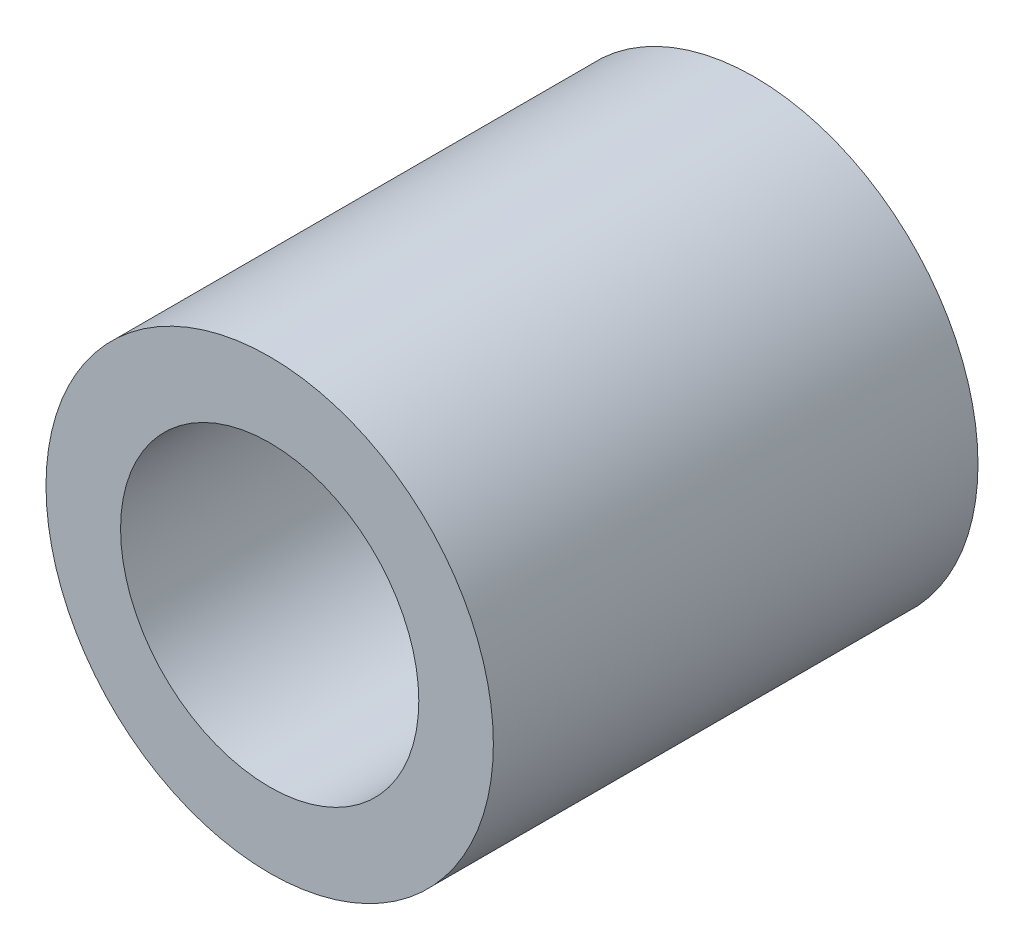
from build123d import *

# Parameters (mm, degrees)
ESQUISSE1_R      = 3
ESQUISSE1_R_2    = 2
EXTRUSION1_DEPTH = 6.5


with BuildPart() as part:
    # Esquisse1 → Extrusion1 (new body)
    with BuildSketch(Plane.XY):
        with Locations(Location((0, 0, 0), (0, 0, 180))):
            Circle(ESQUISSE1_R)
        with Locations(Location((0, 0, 0), (0, 0, 180))):
            Circle(ESQUISSE1_R_2, mode=Mode.SUBTRACT)
    extrude(amount=EXTRUSION1_DEPTH)


solid = part.part
